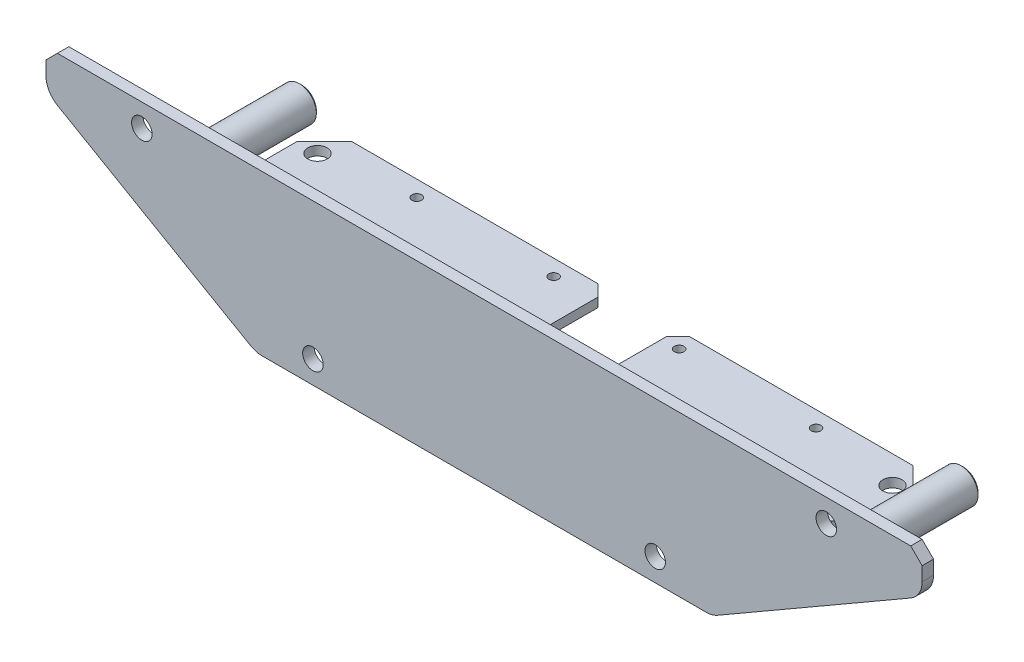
from build123d import *

# Parameters (mm, degrees)
ESQUISSE1_W                = 270
ESQUISSE1_H                = 4
EXTRUSION1_DEPTH           = 60
EXTRUSION2_DEPTH           = 5
ESQUISSE4_R                = 4.5
ENL_V_MAT_EXTRU_3_DEPTH    = 5
ESQUISSE6_R                = 7.5
EXTRUSION3_DEPTH           = 60
EXTRUSION3_2_DEPTH         = 60
TROU_TARAUD_M81_AT_2_COUNT = 2
TROU_TARAUD_M81_AT_2_PITCH = 290
CHANFREIN2_SIZE            = 1
CHANFREIN3_SIZE            = 1
ESQUISSE9_R                = 4.25
ENL_V_MAT_EXTRU_5_DEPTH    = 5
ESQUISSE10_W               = 10
ESQUISSE10_H               = 30
EXTRUSION4_DEPTH           = 32
EXTRUSION4_2_DEPTH         = 32
TROU_TARAUD_M41_AT_2_COUNT = 2
TROU_TARAUD_M41_AT_2_PITCH = 20
TROU_TARAUD_M41_AT_3_COUNT = 2
TROU_TARAUD_M41_AT_3_PITCH = 55
TROU_TARAUD_M41_AT_4_COUNT = 2
TROU_TARAUD_M41_AT_4_PITCH = 58.523499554
ESQUISSE14_W               = 2.1
ESQUISSE14_H               = 36
TROU_TARAUD_M51_AT_2_COUNT = 2
TROU_TARAUD_M51_AT_2_PITCH = 30
TROU_TARAUD_M51_AT_3_COUNT = 2
TROU_TARAUD_M51_AT_3_PITCH = 67.082039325
TROU_TARAUD_M51_AT_4_COUNT = 2
TROU_TARAUD_M51_AT_4_PITCH = 62.649820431
TROU_TARAUD_M51_AT_5_COUNT = 2
TROU_TARAUD_M51_AT_5_PITCH = 55
TROU_TARAUD_M51_AT_6_COUNT = 2
TROU_TARAUD_M51_AT_6_PITCH = 118.84864324
TROU_TARAUD_M51_AT_7_COUNT = 2
TROU_TARAUD_M51_AT_7_PITCH = 60
TROU_TARAUD_M51_AT_8_COUNT = 2
TROU_TARAUD_M51_AT_8_PITCH = 115
CHANFREIN4_SIZE            = 12
CHANFREIN5_SIZE            = 5
CONG_1_R                   = 10
ENL_V_MAT_EXTRU_6_DEPTH    = 205.352636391
CHANFREIN6_SIZE            = 2
CHANFREIN7_SIZE            = 2
ENL_V_MAT_EXTRU_7_DEPTH    = 10
CHANFREIN8_SIZE            = 5


with BuildPart() as part:
    # Esquisse1 → Extrusion1 (new body)
    with BuildSketch(Plane.XY):
        with Locations((0, 34)):
            Rectangle(ESQUISSE1_W, ESQUISSE1_H)
    extrude(amount=-EXTRUSION1_DEPTH)

    # Esquisse9 → Enl_v. mat.-Extru.5 (cut)
    with BuildSketch(Plane(origin=(0, 36, 0), x_dir=(-1, 0, 0), z_dir=(0, 1, 0))):
        with Locations((126, -48)):
            Circle(ESQUISSE9_R)
        with Locations((-126, -48)):
            Circle(ESQUISSE9_R)
    extrude(amount=-ENL_V_MAT_EXTRU_5_DEPTH, mode=Mode.SUBTRACT)

    # Esquisse14 → Trou taraud_ M51 (revolve, cut)
    with BuildSketch(Plane(origin=(27.5, 36, -53), x_dir=(0, 0, 1), z_dir=(1, 0, 0))):
        with Locations((1.05, 18)):
            Rectangle(ESQUISSE14_W, ESQUISSE14_H)
    trou_taraud_m51 = revolve(axis=Axis((27.5, 42.35, -53), (0, -1, 0)), mode=Mode.SUBTRACT)

    # Trou taraud_ M51 at 2: Trou taraud_ M51 ×2
    with Locations(*[(0, 0, i * TROU_TARAUD_M51_AT_2_PITCH) for i in range(1, TROU_TARAUD_M51_AT_2_COUNT)]):
        add(trou_taraud_m51, mode=Mode.SUBTRACT)

    # Trou taraud_ M51 at 3: Trou taraud_ M51 ×2
    with Locations(*[Vector(0.894427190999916, 0, 0.447213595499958) * (i * TROU_TARAUD_M51_AT_3_PITCH) for i in range(1, TROU_TARAUD_M51_AT_3_COUNT)]):
        add(trou_taraud_m51, mode=Mode.SUBTRACT)

    # Trou taraud_ M51 at 4: Trou taraud_ M51 ×2
    with Locations(*[Vector(-0.8778955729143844, 0, 0.4788521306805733) * (i * TROU_TARAUD_M51_AT_4_PITCH) for i in range(1, TROU_TARAUD_M51_AT_4_COUNT)]):
        add(trou_taraud_m51, mode=Mode.SUBTRACT)

    # Trou taraud_ M51 at 5: Trou taraud_ M51 ×2
    with Locations(*[(-i * TROU_TARAUD_M51_AT_5_PITCH, 0, 0) for i in range(1, TROU_TARAUD_M51_AT_5_COUNT)]):
        add(trou_taraud_m51, mode=Mode.SUBTRACT)

    # Trou taraud_ M51 at 6: Trou taraud_ M51 ×2
    with Locations(*[Vector(-0.9676172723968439, 0, 0.25242189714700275) * (i * TROU_TARAUD_M51_AT_6_PITCH) for i in range(1, TROU_TARAUD_M51_AT_6_COUNT)]):
        add(trou_taraud_m51, mode=Mode.SUBTRACT)

    # Trou taraud_ M51 at 7: Trou taraud_ M51 ×2
    with Locations(*[(i * TROU_TARAUD_M51_AT_7_PITCH, 0, 0) for i in range(1, TROU_TARAUD_M51_AT_7_COUNT)]):
        add(trou_taraud_m51, mode=Mode.SUBTRACT)

    # Trou taraud_ M51 at 8: Trou taraud_ M51 ×2
    with Locations(*[(-i * TROU_TARAUD_M51_AT_8_PITCH, 0, 0) for i in range(1, TROU_TARAUD_M51_AT_8_COUNT)]):
        add(trou_taraud_m51, mode=Mode.SUBTRACT)

    # Chanfrein4
    chanfrein4_edges = [part.edges().sort_by_distance(p)[0] for p in [
        (135, 34, -60),
        (-135, 34, -60),
    ]]
    chamfer(chanfrein4_edges, length=CHANFREIN4_SIZE)

    # Esquisse16 → Enl_v. mat.-Extru.6 (cut, symmetric)
    with BuildSketch(Plane(origin=(0, 36, 0), x_dir=(-1, 0, 0), z_dir=(0, 1, 0))):
        Polygon((-607.160306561, -502.160306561), (-135, -30), (-105, 0), (367.160306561, 472.160306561), (-577.160306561, 1416.480919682), (-1551.480919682, 442.160306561), align=None)
    enl_v_mat_extru_6 = extrude(amount=ENL_V_MAT_EXTRU_6_DEPTH, both=True, mode=Mode.SUBTRACT)

    # Sym_trie1: Enl_v. mat.-Extru.6 across plane
    add(enl_v_mat_extru_6.mirror(Plane(origin=(0, 0, 0), x_dir=(0, 0, 1), z_dir=(1, 0, 0))), mode=Mode.SUBTRACT)

    # Esquisse17 → Enl_v. mat.-Extru.7 (cut)
    with BuildSketch(Plane(origin=(0, 36, 0), x_dir=(-1, 0, 0), z_dir=(0, 1, 0))):
        with BuildLine():
            Line((-20, -60), (-20, -25))
            ThreePointArc((-20, -25), (-5, -10), (10, -25))
            Line((10, -25), (10, -60))
            Line((10, -60), (-20, -60))
        make_face()
    extrude(amount=-ENL_V_MAT_EXTRU_7_DEPTH, mode=Mode.SUBTRACT)

    # Chanfrein8
    chanfrein8_edges = [part.edges().sort_by_distance(p)[0] for p in [
        (-10, 34, -60),
        (20, 34, -60),
    ]]
    chamfer(chanfrein8_edges, length=CHANFREIN8_SIZE)


with BuildPart() as body_2:
    # Esquisse2 → Extrusion2 (new body)
    with BuildSketch(Plane.XY):
        Polygon((100, 0), (192, 53.116224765), (192, 70), (-192, 70), (-192, 53.116224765), (-100, 0), align=None)
    extrude(amount=EXTRUSION2_DEPTH)

    # Esquisse4 → Enl_v. mat.-Extru.3 (cut)
    with BuildSketch(Plane(origin=(0, 0, 0), x_dir=(-1, 0, 0), z_dir=(0, 0, -1))):
        with Locations((-150, 60)):
            Circle(ESQUISSE4_R)
        with Locations((-75, 10)):
            Circle(ESQUISSE4_R)
        with Locations((150, 60)):
            Circle(ESQUISSE4_R)
        with Locations((75, 10)):
            Circle(ESQUISSE4_R)
    extrude(amount=-ENL_V_MAT_EXTRU_3_DEPTH, mode=Mode.SUBTRACT)

    # Chanfrein5
    chanfrein5_edges = [body_2.edges().sort_by_distance(p)[0] for p in [
        (-192, 70, 2.5),
        (192, 70, 2.5),
    ]]
    chamfer(chanfrein5_edges, length=CHANFREIN5_SIZE)

    # Cong_1
    cong_1_edges = [body_2.edges().sort_by_distance(p)[0] for p in [
        (-100, 0, 2.5),
        (-192, 53.116224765, 2.5),
        (192, 53.116224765, 2.5),
        (100, 0, 2.5),
    ]]
    fillet(cong_1_edges, radius=CONG_1_R)


with BuildPart() as body_3:
    # Esquisse6 → Extrusion3 (new body)
    with BuildSketch(Plane(origin=(0, 0, 0), x_dir=(-1, 0, 0), z_dir=(0, 0, -1))):
        with Locations((-145, 40)):
            Circle(ESQUISSE6_R)
    extrude(amount=EXTRUSION3_DEPTH)

    # Esquisse7 → Trou taraud_ M81 (revolve, cut)
    with BuildSketch(Plane(origin=(145, 40, -60), x_dir=(0, 1, 0), z_dir=(1, 0, 0))):
        Polygon((0, 0), (0, 21.962990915), (3.4, 20), (3.4, 0), align=None)
    trou_taraud_m81 = revolve(axis=Axis((145, 40, -66.35), (0, 0, 1)), mode=Mode.SUBTRACT)

    # Chanfrein2
    chanfrein2_edges = [body_3.edges().sort_by_distance(p)[0] for p in [
        (152.5, 40, -60),
    ]]
    chamfer(chanfrein2_edges, length=CHANFREIN2_SIZE)

    # Chanfrein6
    chanfrein6_edges = [body_3.edges().sort_by_distance(p)[0] for p in [
        (145, 36.6, -60),
    ]]
    chamfer(chanfrein6_edges, length=CHANFREIN6_SIZE)


with BuildPart() as body_4:
    # Esquisse6 → Extrusion3 2 (new body)
    with BuildSketch(Plane(origin=(0, 0, 0), x_dir=(-1, 0, 0), z_dir=(0, 0, -1))):
        with Locations((145, 40)):
            Circle(ESQUISSE6_R)
    extrude(amount=EXTRUSION3_2_DEPTH)

    # Trou taraud_ M81 at 2: Trou taraud_ M81 ×2
    with Locations(*[(-i * TROU_TARAUD_M81_AT_2_PITCH, 0, 0) for i in range(1, TROU_TARAUD_M81_AT_2_COUNT)]):
        add(trou_taraud_m81, mode=Mode.SUBTRACT)

    # Chanfrein3
    chanfrein3_edges = [body_4.edges().sort_by_distance(p)[0] for p in [
        (-137.5, 40, -60),
    ]]
    chamfer(chanfrein3_edges, length=CHANFREIN3_SIZE)

    # Chanfrein7
    chanfrein7_edges = [body_4.edges().sort_by_distance(p)[0] for p in [
        (-145, 36.6, -60),
    ]]
    chamfer(chanfrein7_edges, length=CHANFREIN7_SIZE)


with BuildPart() as body_5:
    # Esquisse10 → Extrusion4 (new body)
    with BuildSketch(Plane(origin=(0, 0, 0), x_dir=(-1, 0, 0), z_dir=(0, 0, -1))):
        with Locations((-37, 17)):
            Rectangle(ESQUISSE10_W, ESQUISSE10_H)
    extrude(amount=EXTRUSION4_DEPTH)

    # Esquisse12 → Trou taraud_ M41 (revolve, cut)
    with BuildSketch(Plane(origin=(37, 27, -32), x_dir=(0, 1, 0), z_dir=(1, 0, 0))):
        Polygon((0, 0), (0, 11.052627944), (1.65, 10.1), (1.65, 0), align=None)
    trou_taraud_m41 = revolve(axis=Axis((37, 27, -38.35), (0, 0, 1)), mode=Mode.SUBTRACT)

    # Trou taraud_ M41 at 2: Trou taraud_ M41 ×2
    with Locations(*[(0, -i * TROU_TARAUD_M41_AT_2_PITCH, 0) for i in range(1, TROU_TARAUD_M41_AT_2_COUNT)]):
        add(trou_taraud_m41, mode=Mode.SUBTRACT)


with BuildPart() as body_6:
    # Esquisse10 → Extrusion4 2 (new body)
    with BuildSketch(Plane(origin=(0, 0, 0), x_dir=(-1, 0, 0), z_dir=(0, 0, -1))):
        with Locations((18, 17)):
            Rectangle(ESQUISSE10_W, ESQUISSE10_H)
    extrude(amount=EXTRUSION4_2_DEPTH)

    # Trou taraud_ M41 at 3: Trou taraud_ M41 ×2
    with Locations(*[(-i * TROU_TARAUD_M41_AT_3_PITCH, 0, 0) for i in range(1, TROU_TARAUD_M41_AT_3_COUNT)]):
        add(trou_taraud_m41, mode=Mode.SUBTRACT)

    # Trou taraud_ M41 at 4: Trou taraud_ M41 ×2
    with Locations(*[Vector(-0.9397934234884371, -0.34174306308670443, 0) * (i * TROU_TARAUD_M41_AT_4_PITCH) for i in range(1, TROU_TARAUD_M41_AT_4_COUNT)]):
        add(trou_taraud_m41, mode=Mode.SUBTRACT)


solid = Compound([part.part, body_2.part, body_3.part, body_4.part, body_5.part, body_6.part])
